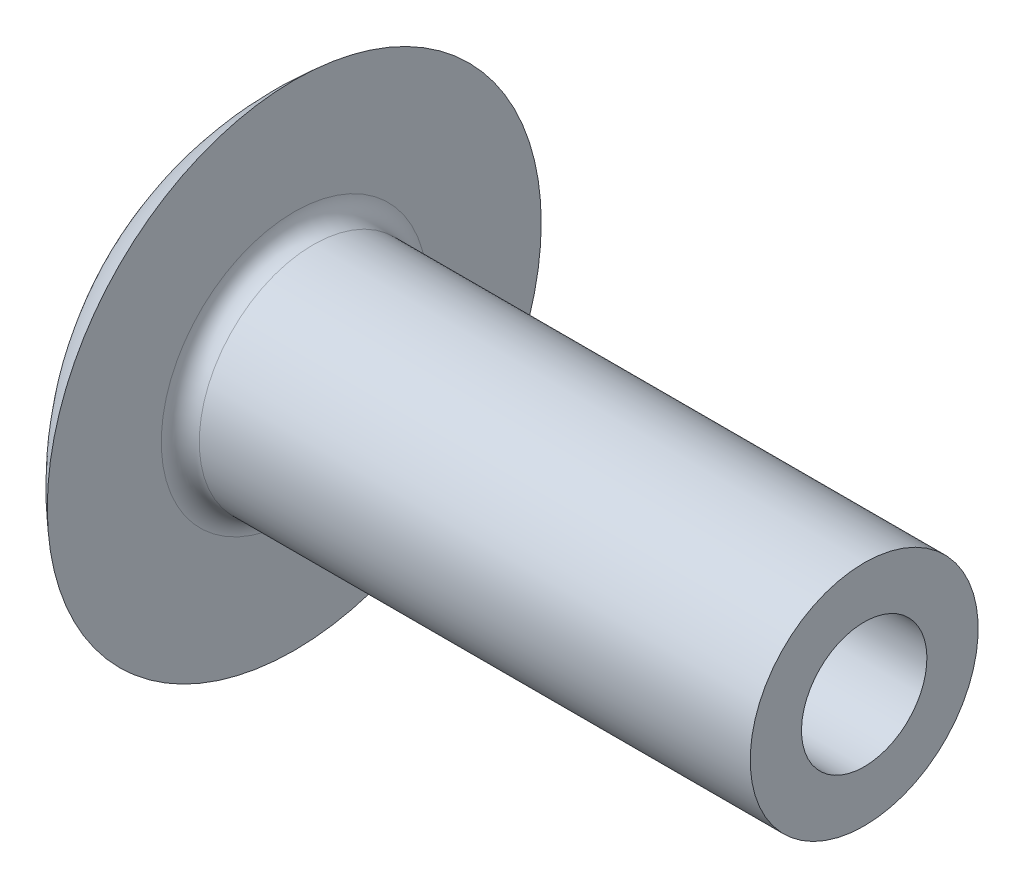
ISO-10303-21;
HEADER;
FILE_DESCRIPTION(('STEP AP214'),'2;1');
FILE_NAME('part.step','',(''),(''),'','','');
FILE_SCHEMA(('AUTOMOTIVE_DESIGN { 1 0 10303 214 1 1 1 1 }'));
ENDSEC;
DATA;
#1=APPLICATION_CONTEXT('core data for automotive mechanical design processes');
#2=APPLICATION_PROTOCOL_DEFINITION('international standard','automotive_design',2000,#1);
#3=PRODUCT_CONTEXT('',#1,'mechanical');
#4=PRODUCT('Part','Part','',(#3));
#5=PRODUCT_RELATED_PRODUCT_CATEGORY('part','',(#4));
#6=PRODUCT_DEFINITION_FORMATION('','',#4);
#7=PRODUCT_DEFINITION_CONTEXT('part definition',#1,'design');
#8=PRODUCT_DEFINITION('design','',#6,#7);
#9=PRODUCT_DEFINITION_SHAPE('','',#8);
#10=(LENGTH_UNIT() NAMED_UNIT(*) SI_UNIT(.MILLI.,.METRE.));
#11=(NAMED_UNIT(*) PLANE_ANGLE_UNIT() SI_UNIT($,.RADIAN.));
#12=(NAMED_UNIT(*) SI_UNIT($,.STERADIAN.) SOLID_ANGLE_UNIT());
#13=UNCERTAINTY_MEASURE_WITH_UNIT(LENGTH_MEASURE(1.E-05),#10,'distance_accuracy_value','');
#14=(GEOMETRIC_REPRESENTATION_CONTEXT(3) GLOBAL_UNCERTAINTY_ASSIGNED_CONTEXT((#13)) GLOBAL_UNIT_ASSIGNED_CONTEXT((#10,
#11,#12)) REPRESENTATION_CONTEXT('',''));
#15=CARTESIAN_POINT('',(0.,0.,0.));
#16=DIRECTION('',(0.,0.,1.));
#17=DIRECTION('',(1.,0.,0.));
#18=AXIS2_PLACEMENT_3D('',#15,#16,#17);
#19=CARTESIAN_POINT('',(-6.85818437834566,0.,0.));
#20=DIRECTION('',(-1.,0.,0.));
#21=DIRECTION('',(0.,-1.,0.));
#22=AXIS2_PLACEMENT_3D('',#19,#20,#21);
#23=CYLINDRICAL_SURFACE('',#22,0.6);
#24=CARTESIAN_POINT('',(0.7,0.,0.));
#25=DIRECTION('',(-1.,0.,0.));
#26=DIRECTION('',(0.,-1.,0.));
#27=AXIS2_PLACEMENT_3D('',#24,#25,#26);
#28=CIRCLE('',#27,0.6);
#29=CARTESIAN_POINT('',(0.7,-0.6,0.));
#30=VERTEX_POINT('',#29);
#31=EDGE_CURVE('E11',#30,#30,#28,.F.);
#32=ORIENTED_EDGE('',*,*,#31,.T.);
#33=EDGE_LOOP('',(#32));
#34=FACE_BOUND('',#33,.T.);
#35=CARTESIAN_POINT('',(3.6,0.,0.));
#36=DIRECTION('',(-1.,0.,0.));
#37=DIRECTION('',(0.,-1.,0.));
#38=AXIS2_PLACEMENT_3D('',#35,#36,#37);
#39=CIRCLE('',#38,0.6);
#40=CARTESIAN_POINT('',(3.6,-0.599999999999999,0.));
#41=VERTEX_POINT('',#40);
#42=EDGE_CURVE('E71',#41,#41,#39,.T.);
#43=ORIENTED_EDGE('',*,*,#42,.T.);
#44=EDGE_LOOP('',(#43));
#45=FACE_BOUND('',#44,.T.);
#46=ADVANCED_FACE('F33',(#34,#45),#23,.T.);
#47=CARTESIAN_POINT('',(0.6,0.6,0.));
#48=DIRECTION('',(-1.,0.,0.));
#49=DIRECTION('',(0.,-1.,0.));
#50=AXIS2_PLACEMENT_3D('',#47,#48,#49);
#51=PLANE('',#50);
#52=CARTESIAN_POINT('',(0.6,0.,0.));
#53=DIRECTION('',(-1.,0.,0.));
#54=DIRECTION('',(0.,-1.,0.));
#55=AXIS2_PLACEMENT_3D('',#52,#53,#54);
#56=CIRCLE('',#55,0.7);
#57=CARTESIAN_POINT('',(0.6,-0.7,0.));
#58=VERTEX_POINT('',#57);
#59=EDGE_CURVE('E40',#58,#58,#56,.T.);
#60=ORIENTED_EDGE('',*,*,#59,.T.);
#61=EDGE_LOOP('',(#60));
#62=FACE_BOUND('',#61,.T.);
#63=CARTESIAN_POINT('',(0.6,0.,0.));
#64=DIRECTION('',(-1.,0.,0.));
#65=DIRECTION('',(0.,-1.,0.));
#66=AXIS2_PLACEMENT_3D('',#63,#64,#65);
#67=CIRCLE('',#66,1.3);
#68=CARTESIAN_POINT('',(0.6,-1.3,0.));
#69=VERTEX_POINT('',#68);
#70=EDGE_CURVE('E81',#69,#69,#67,.T.);
#71=ORIENTED_EDGE('',*,*,#70,.F.);
#72=EDGE_LOOP('',(#71));
#73=FACE_BOUND('',#72,.T.);
#74=ADVANCED_FACE('F56',(#62,#73),#51,.F.);
#75=CARTESIAN_POINT('',(1.70833333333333,0.,0.));
#76=DIRECTION('',(-1.,0.,0.));
#77=DIRECTION('',(0.,1.,0.));
#78=AXIS2_PLACEMENT_3D('',#75,#76,#77);
#79=SPHERICAL_SURFACE('',#78,1.70833333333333);
#80=ORIENTED_EDGE('',*,*,#70,.T.);
#81=EDGE_LOOP('',(#80));
#82=FACE_BOUND('',#81,.T.);
#83=ADVANCED_FACE('F46',(#82),#79,.T.);
#84=CARTESIAN_POINT('',(1.96947441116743,0.,0.));
#85=DIRECTION('',(1.,0.,0.));
#86=DIRECTION('',(0.,1.,0.));
#87=AXIS2_PLACEMENT_3D('',#84,#85,#86);
#88=CONICAL_SURFACE('',#87,0.,1.0471975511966);
#89=CARTESIAN_POINT('',(2.16,0.,0.));
#90=DIRECTION('',(-1.,0.,0.));
#91=DIRECTION('',(0.,-1.,0.));
#92=AXIS2_PLACEMENT_3D('',#89,#90,#91);
#93=CIRCLE('',#92,0.33);
#94=CARTESIAN_POINT('',(2.16,-0.33,0.));
#95=VERTEX_POINT('',#94);
#96=EDGE_CURVE('E76',#95,#95,#93,.T.);
#97=ORIENTED_EDGE('',*,*,#96,.F.);
#98=EDGE_LOOP('',(#97));
#99=FACE_BOUND('',#98,.T.);
#100=CARTESIAN_POINT('',(1.96947441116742,0.,0.));
#101=VERTEX_POINT('',#100);
#102=VERTEX_LOOP('',#101);
#103=FACE_BOUND('',#102,.T.);
#104=ADVANCED_FACE('F43',(#99,#103),#88,.F.);
#105=CARTESIAN_POINT('',(-6.85818437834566,0.,0.));
#106=DIRECTION('',(-1.,0.,0.));
#107=DIRECTION('',(0.,-1.,0.));
#108=AXIS2_PLACEMENT_3D('',#105,#106,#107);
#109=CYLINDRICAL_SURFACE('',#108,0.33);
#110=CARTESIAN_POINT('',(3.6,0.,0.));
#111=DIRECTION('',(-1.,0.,0.));
#112=DIRECTION('',(0.,-1.,0.));
#113=AXIS2_PLACEMENT_3D('',#110,#111,#112);
#114=CIRCLE('',#113,0.33);
#115=CARTESIAN_POINT('',(3.6,-0.33,0.));
#116=VERTEX_POINT('',#115);
#117=EDGE_CURVE('E73',#116,#116,#114,.T.);
#118=ORIENTED_EDGE('',*,*,#117,.F.);
#119=EDGE_LOOP('',(#118));
#120=FACE_BOUND('',#119,.T.);
#121=ORIENTED_EDGE('',*,*,#96,.T.);
#122=EDGE_LOOP('',(#121));
#123=FACE_BOUND('',#122,.T.);
#124=ADVANCED_FACE('F45',(#120,#123),#109,.F.);
#125=CARTESIAN_POINT('',(3.6,0.33,0.));
#126=DIRECTION('',(-1.,0.,0.));
#127=DIRECTION('',(0.,-1.,0.));
#128=AXIS2_PLACEMENT_3D('',#125,#126,#127);
#129=PLANE('',#128);
#130=ORIENTED_EDGE('',*,*,#42,.F.);
#131=EDGE_LOOP('',(#130));
#132=FACE_BOUND('',#131,.T.);
#133=ORIENTED_EDGE('',*,*,#117,.T.);
#134=EDGE_LOOP('',(#133));
#135=FACE_BOUND('',#134,.T.);
#136=ADVANCED_FACE('F53',(#132,#135),#129,.F.);
#137=CARTESIAN_POINT('',(0.7,0.,0.));
#138=DIRECTION('',(-1.,0.,0.));
#139=DIRECTION('',(0.,-1.,0.));
#140=AXIS2_PLACEMENT_3D('',#137,#138,#139);
#141=TOROIDAL_SURFACE('',#140,0.7,0.1);
#142=ORIENTED_EDGE('',*,*,#31,.F.);
#143=EDGE_LOOP('',(#142));
#144=FACE_BOUND('',#143,.T.);
#145=ORIENTED_EDGE('',*,*,#59,.F.);
#146=EDGE_LOOP('',(#145));
#147=FACE_BOUND('',#146,.T.);
#148=ADVANCED_FACE('F35',(#144,#147),#141,.F.);
#149=CLOSED_SHELL('',(#46,#74,#83,#104,#124,#136,#148));
#150=MANIFOLD_SOLID_BREP('B2',#149);
#151=ADVANCED_BREP_SHAPE_REPRESENTATION('',(#18,#150),#14);
#152=SHAPE_DEFINITION_REPRESENTATION(#9,#151);
ENDSEC;
END-ISO-10303-21;
